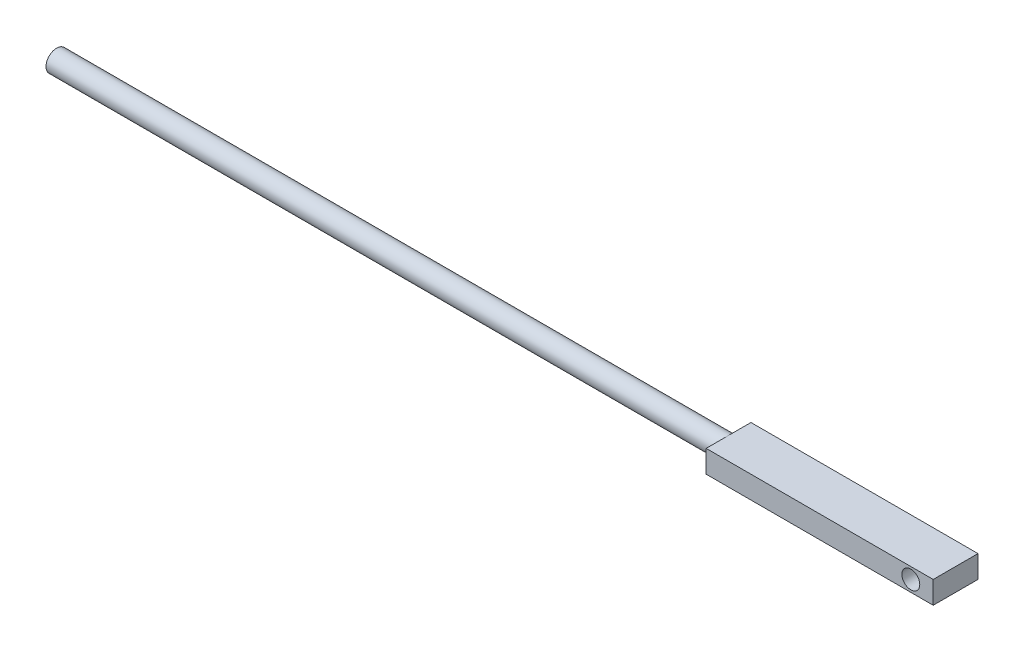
ISO-10303-21;
HEADER;
FILE_DESCRIPTION(('STEP AP214'),'2;1');
FILE_NAME('part.step','',(''),(''),'','','');
FILE_SCHEMA(('AUTOMOTIVE_DESIGN { 1 0 10303 214 1 1 1 1 }'));
ENDSEC;
DATA;
#1=APPLICATION_CONTEXT('core data for automotive mechanical design processes');
#2=APPLICATION_PROTOCOL_DEFINITION('international standard','automotive_design',2000,#1);
#3=PRODUCT_CONTEXT('',#1,'mechanical');
#4=PRODUCT('Part','Part','',(#3));
#5=PRODUCT_RELATED_PRODUCT_CATEGORY('part','',(#4));
#6=PRODUCT_DEFINITION_FORMATION('','',#4);
#7=PRODUCT_DEFINITION_CONTEXT('part definition',#1,'design');
#8=PRODUCT_DEFINITION('design','',#6,#7);
#9=PRODUCT_DEFINITION_SHAPE('','',#8);
#10=(LENGTH_UNIT() NAMED_UNIT(*) SI_UNIT(.MILLI.,.METRE.));
#11=(NAMED_UNIT(*) PLANE_ANGLE_UNIT() SI_UNIT($,.RADIAN.));
#12=(NAMED_UNIT(*) SI_UNIT($,.STERADIAN.) SOLID_ANGLE_UNIT());
#13=UNCERTAINTY_MEASURE_WITH_UNIT(LENGTH_MEASURE(1.E-05),#10,'distance_accuracy_value','');
#14=(GEOMETRIC_REPRESENTATION_CONTEXT(3) GLOBAL_UNCERTAINTY_ASSIGNED_CONTEXT((#13)) GLOBAL_UNIT_ASSIGNED_CONTEXT((#10,
#11,#12)) REPRESENTATION_CONTEXT('',''));
#15=CARTESIAN_POINT('',(0.,0.,0.));
#16=DIRECTION('',(0.,0.,1.));
#17=DIRECTION('',(1.,0.,0.));
#18=AXIS2_PLACEMENT_3D('',#15,#16,#17);
#19=CARTESIAN_POINT('',(0.,0.,20.));
#20=DIRECTION('',(0.,1.,0.));
#21=DIRECTION('',(0.,0.,1.));
#22=AXIS2_PLACEMENT_3D('',#19,#20,#21);
#23=PLANE('',#22);
#24=DIRECTION('',(0.,0.,1.));
#25=VECTOR('',#24,1.);
#26=CARTESIAN_POINT('',(300.,0.,20.));
#27=LINE('',#26,#25);
#28=CARTESIAN_POINT('',(300.,0.,0.));
#29=VERTEX_POINT('',#28);
#30=CARTESIAN_POINT('',(300.,0.,20.));
#31=VERTEX_POINT('',#30);
#32=EDGE_CURVE('E131',#29,#31,#27,.T.);
#33=ORIENTED_EDGE('',*,*,#32,.F.);
#34=DIRECTION('',(1.,0.,0.));
#35=VECTOR('',#34,1.);
#36=CARTESIAN_POINT('',(0.,0.,0.));
#37=LINE('',#36,#35);
#38=CARTESIAN_POINT('',(401.37,0.,0.));
#39=VERTEX_POINT('',#38);
#40=EDGE_CURVE('E94',#29,#39,#37,.T.);
#41=ORIENTED_EDGE('',*,*,#40,.T.);
#42=DIRECTION('',(0.,0.,-1.));
#43=VECTOR('',#42,1.);
#44=CARTESIAN_POINT('',(401.37,0.,20.));
#45=LINE('',#44,#43);
#46=CARTESIAN_POINT('',(401.37,0.,20.));
#47=VERTEX_POINT('',#46);
#48=EDGE_CURVE('E55',#47,#39,#45,.T.);
#49=ORIENTED_EDGE('',*,*,#48,.F.);
#50=DIRECTION('',(1.,0.,0.));
#51=VECTOR('',#50,1.);
#52=CARTESIAN_POINT('',(0.,0.,20.));
#53=LINE('',#52,#51);
#54=EDGE_CURVE('E104',#31,#47,#53,.T.);
#55=ORIENTED_EDGE('',*,*,#54,.F.);
#56=EDGE_LOOP('',(#33,#41,#49,#55));
#57=FACE_BOUND('',#56,.T.);
#58=ADVANCED_FACE('F46',(#57),#23,.F.);
#59=CARTESIAN_POINT('',(0.,10.,20.));
#60=DIRECTION('',(0.,-1.,0.));
#61=DIRECTION('',(0.,0.,-1.));
#62=AXIS2_PLACEMENT_3D('',#59,#60,#61);
#63=PLANE('',#62);
#64=DIRECTION('',(0.,0.,-1.));
#65=VECTOR('',#64,1.);
#66=CARTESIAN_POINT('',(300.,10.,20.));
#67=LINE('',#66,#65);
#68=CARTESIAN_POINT('',(300.,10.,20.));
#69=VERTEX_POINT('',#68);
#70=CARTESIAN_POINT('',(300.,10.,0.));
#71=VERTEX_POINT('',#70);
#72=EDGE_CURVE('E62',#69,#71,#67,.T.);
#73=ORIENTED_EDGE('',*,*,#72,.F.);
#74=DIRECTION('',(-1.,0.,0.));
#75=VECTOR('',#74,1.);
#76=CARTESIAN_POINT('',(0.,10.,20.));
#77=LINE('',#76,#75);
#78=CARTESIAN_POINT('',(401.37,10.,20.));
#79=VERTEX_POINT('',#78);
#80=EDGE_CURVE('E99',#79,#69,#77,.T.);
#81=ORIENTED_EDGE('',*,*,#80,.F.);
#82=DIRECTION('',(0.,0.,-1.));
#83=VECTOR('',#82,1.);
#84=CARTESIAN_POINT('',(401.37,10.,20.));
#85=LINE('',#84,#83);
#86=CARTESIAN_POINT('',(401.37,10.,0.));
#87=VERTEX_POINT('',#86);
#88=EDGE_CURVE('E86',#79,#87,#85,.T.);
#89=ORIENTED_EDGE('',*,*,#88,.T.);
#90=DIRECTION('',(-1.,0.,0.));
#91=VECTOR('',#90,1.);
#92=CARTESIAN_POINT('',(0.,10.,0.));
#93=LINE('',#92,#91);
#94=EDGE_CURVE('E93',#87,#71,#93,.T.);
#95=ORIENTED_EDGE('',*,*,#94,.T.);
#96=EDGE_LOOP('',(#73,#81,#89,#95));
#97=FACE_BOUND('',#96,.T.);
#98=ADVANCED_FACE('F98',(#97),#63,.F.);
#99=CARTESIAN_POINT('',(0.,0.,20.));
#100=DIRECTION('',(0.,0.,-1.));
#101=DIRECTION('',(-1.,0.,0.));
#102=AXIS2_PLACEMENT_3D('',#99,#100,#101);
#103=PLANE('',#102);
#104=CARTESIAN_POINT('',(391.37,5.,20.));
#105=DIRECTION('',(0.,0.,1.));
#106=DIRECTION('',(1.,0.,0.));
#107=AXIS2_PLACEMENT_3D('',#104,#105,#106);
#108=CIRCLE('',#107,3.99999999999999);
#109=CARTESIAN_POINT('',(395.37,5.,20.));
#110=VERTEX_POINT('',#109);
#111=EDGE_CURVE('E121',#110,#110,#108,.T.);
#112=ORIENTED_EDGE('',*,*,#111,.F.);
#113=EDGE_LOOP('',(#112));
#114=FACE_BOUND('',#113,.T.);
#115=DIRECTION('',(0.,1.,0.));
#116=VECTOR('',#115,1.);
#117=CARTESIAN_POINT('',(300.,0.,20.));
#118=LINE('',#117,#116);
#119=EDGE_CURVE('E127',#31,#69,#118,.T.);
#120=ORIENTED_EDGE('',*,*,#119,.F.);
#121=ORIENTED_EDGE('',*,*,#54,.T.);
#122=DIRECTION('',(0.,1.,0.));
#123=VECTOR('',#122,1.);
#124=CARTESIAN_POINT('',(401.37,0.,20.));
#125=LINE('',#124,#123);
#126=EDGE_CURVE('E70',#47,#79,#125,.T.);
#127=ORIENTED_EDGE('',*,*,#126,.T.);
#128=ORIENTED_EDGE('',*,*,#80,.T.);
#129=EDGE_LOOP('',(#120,#121,#127,#128));
#130=FACE_BOUND('',#129,.T.);
#131=ADVANCED_FACE('F158',(#114,#130),#103,.F.);
#132=CARTESIAN_POINT('',(0.,0.,0.));
#133=DIRECTION('',(0.,0.,-1.));
#134=DIRECTION('',(-1.,0.,0.));
#135=AXIS2_PLACEMENT_3D('',#132,#133,#134);
#136=PLANE('',#135);
#137=CARTESIAN_POINT('',(391.37,5.,0.));
#138=DIRECTION('',(0.,0.,1.));
#139=DIRECTION('',(1.,0.,0.));
#140=AXIS2_PLACEMENT_3D('',#137,#138,#139);
#141=CIRCLE('',#140,3.99999999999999);
#142=CARTESIAN_POINT('',(395.37,5.,0.));
#143=VERTEX_POINT('',#142);
#144=EDGE_CURVE('E116',#143,#143,#141,.T.);
#145=ORIENTED_EDGE('',*,*,#144,.T.);
#146=EDGE_LOOP('',(#145));
#147=FACE_BOUND('',#146,.T.);
#148=ORIENTED_EDGE('',*,*,#40,.F.);
#149=DIRECTION('',(0.,1.,0.));
#150=VECTOR('',#149,1.);
#151=CARTESIAN_POINT('',(300.,0.,0.));
#152=LINE('',#151,#150);
#153=EDGE_CURVE('E12',#29,#71,#152,.T.);
#154=ORIENTED_EDGE('',*,*,#153,.T.);
#155=ORIENTED_EDGE('',*,*,#94,.F.);
#156=DIRECTION('',(0.,1.,0.));
#157=VECTOR('',#156,1.);
#158=CARTESIAN_POINT('',(401.37,0.,0.));
#159=LINE('',#158,#157);
#160=EDGE_CURVE('E83',#39,#87,#159,.T.);
#161=ORIENTED_EDGE('',*,*,#160,.F.);
#162=EDGE_LOOP('',(#148,#154,#155,#161));
#163=FACE_BOUND('',#162,.T.);
#164=ADVANCED_FACE('F102',(#147,#163),#136,.T.);
#165=CARTESIAN_POINT('',(401.37,0.,20.));
#166=DIRECTION('',(-1.,0.,0.));
#167=DIRECTION('',(0.,0.,1.));
#168=AXIS2_PLACEMENT_3D('',#165,#166,#167);
#169=PLANE('',#168);
#170=ORIENTED_EDGE('',*,*,#160,.T.);
#171=ORIENTED_EDGE('',*,*,#88,.F.);
#172=ORIENTED_EDGE('',*,*,#126,.F.);
#173=ORIENTED_EDGE('',*,*,#48,.T.);
#174=EDGE_LOOP('',(#170,#171,#172,#173));
#175=FACE_BOUND('',#174,.T.);
#176=ADVANCED_FACE('F85',(#175),#169,.F.);
#177=CARTESIAN_POINT('',(391.37,5.,0.));
#178=DIRECTION('',(0.,0.,1.));
#179=DIRECTION('',(1.,0.,0.));
#180=AXIS2_PLACEMENT_3D('',#177,#178,#179);
#181=CYLINDRICAL_SURFACE('',#180,3.99999999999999);
#182=ORIENTED_EDGE('',*,*,#144,.F.);
#183=EDGE_LOOP('',(#182));
#184=FACE_BOUND('',#183,.T.);
#185=ORIENTED_EDGE('',*,*,#111,.T.);
#186=EDGE_LOOP('',(#185));
#187=FACE_BOUND('',#186,.T.);
#188=ADVANCED_FACE('F151',(#184,#187),#181,.F.);
#189=CARTESIAN_POINT('',(300.,5.,10.));
#190=DIRECTION('',(-1.,0.,0.));
#191=DIRECTION('',(0.,0.,1.));
#192=AXIS2_PLACEMENT_3D('',#189,#190,#191);
#193=PLANE('',#192);
#194=CARTESIAN_POINT('',(300.,5.,10.));
#195=DIRECTION('',(-1.,0.,0.));
#196=DIRECTION('',(0.,0.,1.));
#197=AXIS2_PLACEMENT_3D('',#194,#195,#196);
#198=CIRCLE('',#197,4.75);
#199=CARTESIAN_POINT('',(300.,5.,14.75));
#200=VERTEX_POINT('',#199);
#201=EDGE_CURVE('E137',#200,#200,#198,.T.);
#202=ORIENTED_EDGE('',*,*,#201,.F.);
#203=EDGE_LOOP('',(#202));
#204=FACE_BOUND('',#203,.T.);
#205=ORIENTED_EDGE('',*,*,#119,.T.);
#206=ORIENTED_EDGE('',*,*,#72,.T.);
#207=ORIENTED_EDGE('',*,*,#153,.F.);
#208=ORIENTED_EDGE('',*,*,#32,.T.);
#209=EDGE_LOOP('',(#205,#206,#207,#208));
#210=FACE_BOUND('',#209,.T.);
#211=ADVANCED_FACE('F149',(#204,#210),#193,.T.);
#212=CARTESIAN_POINT('',(300.,5.,10.));
#213=DIRECTION('',(-1.,0.,0.));
#214=DIRECTION('',(0.,0.,1.));
#215=AXIS2_PLACEMENT_3D('',#212,#213,#214);
#216=CYLINDRICAL_SURFACE('',#215,4.75);
#217=ORIENTED_EDGE('',*,*,#201,.T.);
#218=EDGE_LOOP('',(#217));
#219=FACE_BOUND('',#218,.T.);
#220=CARTESIAN_POINT('',(0.,5.,10.));
#221=DIRECTION('',(-1.,0.,0.));
#222=DIRECTION('',(0.,0.,1.));
#223=AXIS2_PLACEMENT_3D('',#220,#221,#222);
#224=CIRCLE('',#223,4.75);
#225=CARTESIAN_POINT('',(0.,5.,14.75));
#226=VERTEX_POINT('',#225);
#227=EDGE_CURVE('E138',#226,#226,#224,.T.);
#228=ORIENTED_EDGE('',*,*,#227,.F.);
#229=EDGE_LOOP('',(#228));
#230=FACE_BOUND('',#229,.T.);
#231=ADVANCED_FACE('F146',(#219,#230),#216,.T.);
#232=CARTESIAN_POINT('',(0.,0.,20.));
#233=DIRECTION('',(1.,0.,0.));
#234=DIRECTION('',(0.,0.,-1.));
#235=AXIS2_PLACEMENT_3D('',#232,#233,#234);
#236=PLANE('',#235);
#237=ORIENTED_EDGE('',*,*,#227,.T.);
#238=EDGE_LOOP('',(#237));
#239=FACE_BOUND('',#238,.T.);
#240=ADVANCED_FACE('F48',(#239),#236,.F.);
#241=CLOSED_SHELL('',(#58,#98,#131,#164,#176,#188,#211,#231,#240));
#242=MANIFOLD_SOLID_BREP('B2',#241);
#243=ADVANCED_BREP_SHAPE_REPRESENTATION('',(#18,#242),#14);
#244=SHAPE_DEFINITION_REPRESENTATION(#9,#243);
ENDSEC;
END-ISO-10303-21;
